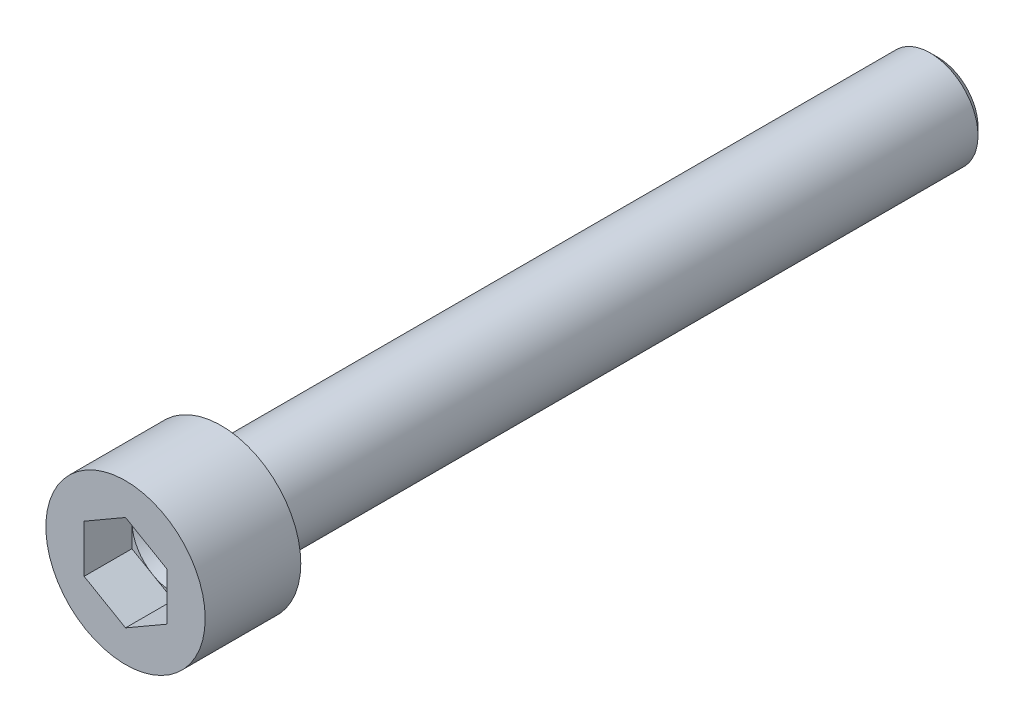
ISO-10303-21;
HEADER;
FILE_DESCRIPTION(('STEP AP214'),'2;1');
FILE_NAME('part.step','',(''),(''),'','','');
FILE_SCHEMA(('AUTOMOTIVE_DESIGN { 1 0 10303 214 1 1 1 1 }'));
ENDSEC;
DATA;
#1=APPLICATION_CONTEXT('core data for automotive mechanical design processes');
#2=APPLICATION_PROTOCOL_DEFINITION('international standard','automotive_design',2000,#1);
#3=PRODUCT_CONTEXT('',#1,'mechanical');
#4=PRODUCT('Part','Part','',(#3));
#5=PRODUCT_RELATED_PRODUCT_CATEGORY('part','',(#4));
#6=PRODUCT_DEFINITION_FORMATION('','',#4);
#7=PRODUCT_DEFINITION_CONTEXT('part definition',#1,'design');
#8=PRODUCT_DEFINITION('design','',#6,#7);
#9=PRODUCT_DEFINITION_SHAPE('','',#8);
#10=(LENGTH_UNIT() NAMED_UNIT(*) SI_UNIT(.MILLI.,.METRE.));
#11=(NAMED_UNIT(*) PLANE_ANGLE_UNIT() SI_UNIT($,.RADIAN.));
#12=(NAMED_UNIT(*) SI_UNIT($,.STERADIAN.) SOLID_ANGLE_UNIT());
#13=UNCERTAINTY_MEASURE_WITH_UNIT(LENGTH_MEASURE(1.E-05),#10,'distance_accuracy_value','');
#14=(GEOMETRIC_REPRESENTATION_CONTEXT(3) GLOBAL_UNCERTAINTY_ASSIGNED_CONTEXT((#13)) GLOBAL_UNIT_ASSIGNED_CONTEXT((#10,
#11,#12)) REPRESENTATION_CONTEXT('',''));
#15=CARTESIAN_POINT('',(0.,0.,0.));
#16=DIRECTION('',(0.,0.,1.));
#17=DIRECTION('',(1.,0.,0.));
#18=AXIS2_PLACEMENT_3D('',#15,#16,#17);
#19=CARTESIAN_POINT('',(0.,0.,-6.));
#20=DIRECTION('',(0.,0.,1.));
#21=DIRECTION('',(1.,0.,0.));
#22=AXIS2_PLACEMENT_3D('',#19,#20,#21);
#23=PLANE('',#22);
#24=CARTESIAN_POINT('',(0.,0.,-6.));
#25=DIRECTION('',(0.,0.,1.));
#26=DIRECTION('',(1.,0.,0.));
#27=AXIS2_PLACEMENT_3D('',#24,#25,#26);
#28=CIRCLE('',#27,5.);
#29=CARTESIAN_POINT('',(5.,0.,-6.));
#30=VERTEX_POINT('',#29);
#31=EDGE_CURVE('E146',#30,#30,#28,.T.);
#32=ORIENTED_EDGE('',*,*,#31,.F.);
#33=EDGE_LOOP('',(#32));
#34=FACE_BOUND('',#33,.T.);
#35=CARTESIAN_POINT('',(0.,0.,-6.));
#36=DIRECTION('',(0.,0.,1.));
#37=DIRECTION('',(1.,0.,0.));
#38=AXIS2_PLACEMENT_3D('',#35,#36,#37);
#39=CIRCLE('',#38,3.);
#40=CARTESIAN_POINT('',(3.,0.,-6.00000000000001));
#41=VERTEX_POINT('',#40);
#42=EDGE_CURVE('E149',#41,#41,#39,.F.);
#43=ORIENTED_EDGE('',*,*,#42,.F.);
#44=EDGE_LOOP('',(#43));
#45=FACE_BOUND('',#44,.T.);
#46=ADVANCED_FACE('F28',(#34,#45),#23,.F.);
#47=CARTESIAN_POINT('',(0.,0.,-6.));
#48=DIRECTION('',(0.,0.,1.));
#49=DIRECTION('',(1.,0.,0.));
#50=AXIS2_PLACEMENT_3D('',#47,#48,#49);
#51=CYLINDRICAL_SURFACE('',#50,5.);
#52=ORIENTED_EDGE('',*,*,#31,.T.);
#53=EDGE_LOOP('',(#52));
#54=FACE_BOUND('',#53,.T.);
#55=CARTESIAN_POINT('',(0.,0.,0.));
#56=DIRECTION('',(0.,0.,1.));
#57=DIRECTION('',(1.,0.,0.));
#58=AXIS2_PLACEMENT_3D('',#55,#56,#57);
#59=CIRCLE('',#58,5.);
#60=CARTESIAN_POINT('',(5.,0.,0.));
#61=VERTEX_POINT('',#60);
#62=EDGE_CURVE('E134',#61,#61,#59,.T.);
#63=ORIENTED_EDGE('',*,*,#62,.F.);
#64=EDGE_LOOP('',(#63));
#65=FACE_BOUND('',#64,.T.);
#66=ADVANCED_FACE('F30',(#54,#65),#51,.T.);
#67=CARTESIAN_POINT('',(0.,0.,0.));
#68=DIRECTION('',(0.,0.,1.));
#69=DIRECTION('',(1.,0.,0.));
#70=AXIS2_PLACEMENT_3D('',#67,#68,#69);
#71=PLANE('',#70);
#72=DIRECTION('',(0.866025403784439,-0.5,0.));
#73=VECTOR('',#72,1.);
#74=CARTESIAN_POINT('',(-2.59807621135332,-1.5,0.));
#75=LINE('',#74,#73);
#76=CARTESIAN_POINT('',(-2.59807621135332,-1.5,0.));
#77=VERTEX_POINT('',#76);
#78=CARTESIAN_POINT('',(0.,-3.,0.));
#79=VERTEX_POINT('',#78);
#80=EDGE_CURVE('E43',#77,#79,#75,.T.);
#81=ORIENTED_EDGE('',*,*,#80,.F.);
#82=DIRECTION('',(0.,-1.,0.));
#83=VECTOR('',#82,1.);
#84=CARTESIAN_POINT('',(-2.59807621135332,1.5,0.));
#85=LINE('',#84,#83);
#86=CARTESIAN_POINT('',(-2.59807621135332,1.5,0.));
#87=VERTEX_POINT('',#86);
#88=EDGE_CURVE('E115',#87,#77,#85,.T.);
#89=ORIENTED_EDGE('',*,*,#88,.F.);
#90=DIRECTION('',(-0.866025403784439,-0.5,0.));
#91=VECTOR('',#90,1.);
#92=CARTESIAN_POINT('',(0.,3.,0.));
#93=LINE('',#92,#91);
#94=CARTESIAN_POINT('',(0.,3.,0.));
#95=VERTEX_POINT('',#94);
#96=EDGE_CURVE('E112',#95,#87,#93,.T.);
#97=ORIENTED_EDGE('',*,*,#96,.F.);
#98=DIRECTION('',(-0.866025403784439,0.5,0.));
#99=VECTOR('',#98,1.);
#100=CARTESIAN_POINT('',(2.59807621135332,1.5,0.));
#101=LINE('',#100,#99);
#102=CARTESIAN_POINT('',(2.59807621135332,1.5,0.));
#103=VERTEX_POINT('',#102);
#104=EDGE_CURVE('E109',#103,#95,#101,.T.);
#105=ORIENTED_EDGE('',*,*,#104,.F.);
#106=DIRECTION('',(0.,1.,0.));
#107=VECTOR('',#106,1.);
#108=CARTESIAN_POINT('',(2.59807621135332,-1.5,0.));
#109=LINE('',#108,#107);
#110=CARTESIAN_POINT('',(2.59807621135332,-1.5,0.));
#111=VERTEX_POINT('',#110);
#112=EDGE_CURVE('E106',#111,#103,#109,.T.);
#113=ORIENTED_EDGE('',*,*,#112,.F.);
#114=DIRECTION('',(0.866025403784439,0.5,0.));
#115=VECTOR('',#114,1.);
#116=CARTESIAN_POINT('',(0.,-3.,0.));
#117=LINE('',#116,#115);
#118=EDGE_CURVE('E97',#79,#111,#117,.T.);
#119=ORIENTED_EDGE('',*,*,#118,.F.);
#120=EDGE_LOOP('',(#81,#89,#97,#105,#113,#119));
#121=FACE_BOUND('',#120,.T.);
#122=ORIENTED_EDGE('',*,*,#62,.T.);
#123=EDGE_LOOP('',(#122));
#124=FACE_BOUND('',#123,.T.);
#125=ADVANCED_FACE('F173',(#121,#124),#71,.T.);
#126=CARTESIAN_POINT('',(0.,0.,-51.));
#127=DIRECTION('',(0.,0.,1.));
#128=DIRECTION('',(1.,0.,0.));
#129=AXIS2_PLACEMENT_3D('',#126,#127,#128);
#130=CYLINDRICAL_SURFACE('',#129,3.);
#131=CARTESIAN_POINT('',(0.,0.,-50.5));
#132=DIRECTION('',(0.,0.,-1.));
#133=DIRECTION('',(-1.,0.,0.));
#134=AXIS2_PLACEMENT_3D('',#131,#132,#133);
#135=CIRCLE('',#134,3.);
#136=CARTESIAN_POINT('',(3.,0.,-50.5));
#137=VERTEX_POINT('',#136);
#138=EDGE_CURVE('E11',#137,#137,#135,.F.);
#139=CARTESIAN_POINT('',(3.,0.,-50.5));
#140=CARTESIAN_POINT('',(3.,0.,-50.0364583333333));
#141=CARTESIAN_POINT('',(3.,0.,-49.5729166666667));
#142=CARTESIAN_POINT('',(3.,0.,-48.6458333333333));
#143=CARTESIAN_POINT('',(3.,0.,-48.1822916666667));
#144=CARTESIAN_POINT('',(3.,0.,-47.2552083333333));
#145=CARTESIAN_POINT('',(3.,0.,-46.7916666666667));
#146=CARTESIAN_POINT('',(3.,0.,-45.8645833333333));
#147=CARTESIAN_POINT('',(3.,0.,-45.4010416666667));
#148=CARTESIAN_POINT('',(3.,0.,-44.4739583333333));
#149=CARTESIAN_POINT('',(3.,0.,-44.0104166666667));
#150=CARTESIAN_POINT('',(3.,0.,-43.0833333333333));
#151=CARTESIAN_POINT('',(3.,0.,-42.6197916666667));
#152=CARTESIAN_POINT('',(3.,0.,-41.6927083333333));
#153=CARTESIAN_POINT('',(3.,0.,-41.2291666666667));
#154=CARTESIAN_POINT('',(3.,0.,-40.3020833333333));
#155=CARTESIAN_POINT('',(3.,0.,-39.8385416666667));
#156=CARTESIAN_POINT('',(3.,0.,-38.9114583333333));
#157=CARTESIAN_POINT('',(3.,0.,-38.4479166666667));
#158=CARTESIAN_POINT('',(3.,0.,-37.5208333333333));
#159=CARTESIAN_POINT('',(3.,0.,-37.0572916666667));
#160=CARTESIAN_POINT('',(3.,0.,-36.1302083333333));
#161=CARTESIAN_POINT('',(3.,0.,-35.6666666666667));
#162=CARTESIAN_POINT('',(3.,0.,-34.7395833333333));
#163=CARTESIAN_POINT('',(3.,0.,-34.2760416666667));
#164=CARTESIAN_POINT('',(3.,0.,-33.3489583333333));
#165=CARTESIAN_POINT('',(3.,0.,-32.8854166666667));
#166=CARTESIAN_POINT('',(3.,0.,-31.9583333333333));
#167=CARTESIAN_POINT('',(3.,0.,-31.4947916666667));
#168=CARTESIAN_POINT('',(3.,0.,-30.5677083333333));
#169=CARTESIAN_POINT('',(3.,0.,-30.1041666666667));
#170=CARTESIAN_POINT('',(3.,0.,-29.1770833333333));
#171=CARTESIAN_POINT('',(3.,0.,-28.7135416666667));
#172=CARTESIAN_POINT('',(3.,0.,-27.7864583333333));
#173=CARTESIAN_POINT('',(3.,0.,-27.3229166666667));
#174=CARTESIAN_POINT('',(3.,0.,-26.3958333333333));
#175=CARTESIAN_POINT('',(3.,0.,-25.9322916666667));
#176=CARTESIAN_POINT('',(3.,0.,-25.0052083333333));
#177=CARTESIAN_POINT('',(3.,0.,-24.5416666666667));
#178=CARTESIAN_POINT('',(3.,0.,-23.6145833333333));
#179=CARTESIAN_POINT('',(3.,0.,-23.1510416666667));
#180=CARTESIAN_POINT('',(3.,0.,-22.2239583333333));
#181=CARTESIAN_POINT('',(3.,0.,-21.7604166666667));
#182=CARTESIAN_POINT('',(3.,0.,-20.8333333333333));
#183=CARTESIAN_POINT('',(3.,0.,-20.3697916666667));
#184=CARTESIAN_POINT('',(3.,0.,-19.4427083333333));
#185=CARTESIAN_POINT('',(3.,0.,-18.9791666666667));
#186=CARTESIAN_POINT('',(3.,0.,-18.0520833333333));
#187=CARTESIAN_POINT('',(3.,0.,-17.5885416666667));
#188=CARTESIAN_POINT('',(3.,0.,-16.6614583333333));
#189=CARTESIAN_POINT('',(3.,0.,-16.1979166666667));
#190=CARTESIAN_POINT('',(3.,0.,-15.2708333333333));
#191=CARTESIAN_POINT('',(3.,0.,-14.8072916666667));
#192=CARTESIAN_POINT('',(3.,0.,-13.8802083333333));
#193=CARTESIAN_POINT('',(3.,0.,-13.4166666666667));
#194=CARTESIAN_POINT('',(3.,0.,-12.4895833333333));
#195=CARTESIAN_POINT('',(3.,0.,-12.0260416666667));
#196=CARTESIAN_POINT('',(3.,0.,-11.0989583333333));
#197=CARTESIAN_POINT('',(3.,0.,-10.6354166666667));
#198=CARTESIAN_POINT('',(3.,0.,-9.70833333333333));
#199=CARTESIAN_POINT('',(3.,0.,-9.24479166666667));
#200=CARTESIAN_POINT('',(3.,0.,-8.31770833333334));
#201=CARTESIAN_POINT('',(3.,0.,-7.85416666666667));
#202=CARTESIAN_POINT('',(3.,0.,-6.92708333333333));
#203=CARTESIAN_POINT('',(3.,0.,-6.46354166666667));
#204=CARTESIAN_POINT('',(3.,0.,-6.00000000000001));
#205=B_SPLINE_CURVE_WITH_KNOTS('',3,(#139,#140,#141,#142,#143,#144,#145,#146,#147,#148,#149,
#150,#151,#152,#153,#154,#155,#156,#157,#158,#159,#160,#161,#162,#163,#164,#165,#166,#167,#168,
#169,#170,#171,#172,#173,#174,#175,#176,#177,#178,#179,#180,#181,#182,#183,#184,#185,#186,#187,
#188,#189,#190,#191,#192,#193,#194,#195,#196,#197,#198,#199,#200,#201,#202,#203,#204),
.UNSPECIFIED.,.F.,.F.,(4,2,2,2,2,2,2,2,2,2,2,2,2,2,2,2,2,2,2,2,2,2,2,2,2,2,2,2,2,2,2,2,4),(0.,
1.39062500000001,2.78125000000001,4.17187500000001,5.56250000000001,6.953125,8.34375,9.734375,
11.125,12.515625,13.90625,15.296875,16.6875,18.078125,19.46875,20.859375,22.25,23.640625,
25.03125,26.421875,27.8125,29.203125,30.59375,31.984375,33.375,34.765625,36.15625,37.546875,
38.9375,40.328125,41.71875,43.109375,44.5),.UNSPECIFIED.);
#206=EDGE_CURVE('BSEAM180',#137,#41,#205,.T.);
#207=ORIENTED_EDGE('',*,*,#138,.T.);
#208=ORIENTED_EDGE('',*,*,#42,.T.);
#209=ORIENTED_EDGE('',*,*,#206,.T.);
#210=ORIENTED_EDGE('',*,*,#206,.F.);
#211=EDGE_LOOP('',(#207,#209,#208,#210));
#212=FACE_BOUND('',#211,.T.);
#213=ADVANCED_FACE('F180',(#212),#130,.T.);
#214=CARTESIAN_POINT('',(0.,0.,-51.));
#215=DIRECTION('',(0.,0.,-1.));
#216=DIRECTION('',(-1.,0.,0.));
#217=AXIS2_PLACEMENT_3D('',#214,#215,#216);
#218=PLANE('',#217);
#219=CARTESIAN_POINT('',(0.,0.,-51.));
#220=DIRECTION('',(0.,0.,-1.));
#221=DIRECTION('',(-1.,0.,0.));
#222=AXIS2_PLACEMENT_3D('',#219,#220,#221);
#223=CIRCLE('',#222,2.5);
#224=CARTESIAN_POINT('',(-2.5,0.,-51.));
#225=VERTEX_POINT('',#224);
#226=EDGE_CURVE('E36',#225,#225,#223,.T.);
#227=ORIENTED_EDGE('',*,*,#226,.T.);
#228=EDGE_LOOP('',(#227));
#229=FACE_BOUND('',#228,.T.);
#230=ADVANCED_FACE('F154',(#229),#218,.T.);
#231=CARTESIAN_POINT('',(-2.59807621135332,-1.5,-3.));
#232=DIRECTION('',(-0.5,-0.866025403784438,0.));
#233=DIRECTION('',(0.866025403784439,-0.5,0.));
#234=AXIS2_PLACEMENT_3D('',#231,#232,#233);
#235=PLANE('',#234);
#236=ORIENTED_EDGE('',*,*,#80,.T.);
#237=DIRECTION('',(0.,0.,1.));
#238=VECTOR('',#237,1.);
#239=CARTESIAN_POINT('',(0.,-3.,-3.));
#240=LINE('',#239,#238);
#241=CARTESIAN_POINT('',(2.59299926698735E-06,-2.99999999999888,-3.));
#242=VERTEX_POINT('',#241);
#243=EDGE_CURVE('E131',#242,#79,#240,.T.);
#244=ORIENTED_EDGE('',*,*,#243,.F.);
#245=DIRECTION('',(0.866025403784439,-0.5,0.));
#246=VECTOR('',#245,1.);
#247=CARTESIAN_POINT('',(-2.59807621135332,-1.5,-3.));
#248=LINE('',#247,#246);
#249=CARTESIAN_POINT('',(-2.59807491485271,-1.50000224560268,-3.));
#250=VERTEX_POINT('',#249);
#251=EDGE_CURVE('E118',#250,#242,#248,.T.);
#252=ORIENTED_EDGE('',*,*,#251,.F.);
#253=DIRECTION('',(0.,0.,1.));
#254=VECTOR('',#253,1.);
#255=CARTESIAN_POINT('',(-2.59807621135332,-1.5,-3.));
#256=LINE('',#255,#254);
#257=EDGE_CURVE('E132',#250,#77,#256,.T.);
#258=ORIENTED_EDGE('',*,*,#257,.T.);
#259=EDGE_LOOP('',(#236,#244,#252,#258));
#260=FACE_BOUND('',#259,.T.);
#261=ADVANCED_FACE('F187',(#260),#235,.F.);
#262=CARTESIAN_POINT('',(-2.59807621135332,1.5,-3.));
#263=DIRECTION('',(-1.,0.,0.));
#264=DIRECTION('',(0.,-1.,0.));
#265=AXIS2_PLACEMENT_3D('',#262,#263,#264);
#266=PLANE('',#265);
#267=ORIENTED_EDGE('',*,*,#88,.T.);
#268=ORIENTED_EDGE('',*,*,#257,.F.);
#269=DIRECTION('',(0.,-1.,0.));
#270=VECTOR('',#269,1.);
#271=CARTESIAN_POINT('',(-2.59807621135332,1.5,-3.));
#272=LINE('',#271,#270);
#273=CARTESIAN_POINT('',(-2.59807621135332,1.5,-3.));
#274=VERTEX_POINT('',#273);
#275=EDGE_CURVE('E129',#274,#250,#272,.T.);
#276=ORIENTED_EDGE('',*,*,#275,.F.);
#277=DIRECTION('',(0.,0.,1.));
#278=VECTOR('',#277,1.);
#279=CARTESIAN_POINT('',(-2.59807621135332,1.5,-3.));
#280=LINE('',#279,#278);
#281=EDGE_CURVE('E135',#274,#87,#280,.T.);
#282=ORIENTED_EDGE('',*,*,#281,.T.);
#283=EDGE_LOOP('',(#267,#268,#276,#282));
#284=FACE_BOUND('',#283,.T.);
#285=ADVANCED_FACE('F190',(#284),#266,.F.);
#286=CARTESIAN_POINT('',(0.,3.,-3.));
#287=DIRECTION('',(-0.5,0.866025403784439,0.));
#288=DIRECTION('',(-0.866025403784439,-0.5,0.));
#289=AXIS2_PLACEMENT_3D('',#286,#287,#288);
#290=PLANE('',#289);
#291=ORIENTED_EDGE('',*,*,#96,.T.);
#292=ORIENTED_EDGE('',*,*,#281,.F.);
#293=DIRECTION('',(-0.866025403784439,-0.5,0.));
#294=VECTOR('',#293,1.);
#295=CARTESIAN_POINT('',(0.,3.,-3.));
#296=LINE('',#295,#294);
#297=CARTESIAN_POINT('',(-2.59299926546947E-06,2.99999999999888,-3.));
#298=VERTEX_POINT('',#297);
#299=EDGE_CURVE('E126',#298,#274,#296,.T.);
#300=ORIENTED_EDGE('',*,*,#299,.F.);
#301=DIRECTION('',(0.,0.,1.));
#302=VECTOR('',#301,1.);
#303=CARTESIAN_POINT('',(0.,3.,-3.));
#304=LINE('',#303,#302);
#305=EDGE_CURVE('E137',#298,#95,#304,.T.);
#306=ORIENTED_EDGE('',*,*,#305,.T.);
#307=EDGE_LOOP('',(#291,#292,#300,#306));
#308=FACE_BOUND('',#307,.T.);
#309=ADVANCED_FACE('F203',(#308),#290,.F.);
#310=CARTESIAN_POINT('',(2.59807621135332,1.5,-3.));
#311=DIRECTION('',(0.5,0.866025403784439,0.));
#312=DIRECTION('',(-0.866025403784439,0.5,0.));
#313=AXIS2_PLACEMENT_3D('',#310,#311,#312);
#314=PLANE('',#313);
#315=ORIENTED_EDGE('',*,*,#104,.T.);
#316=ORIENTED_EDGE('',*,*,#305,.F.);
#317=DIRECTION('',(-0.866025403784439,0.5,0.));
#318=VECTOR('',#317,1.);
#319=CARTESIAN_POINT('',(2.59807621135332,1.5,-3.));
#320=LINE('',#319,#318);
#321=CARTESIAN_POINT('',(2.59807491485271,1.50000224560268,-3.));
#322=VERTEX_POINT('',#321);
#323=EDGE_CURVE('E124',#322,#298,#320,.T.);
#324=ORIENTED_EDGE('',*,*,#323,.F.);
#325=DIRECTION('',(0.,0.,1.));
#326=VECTOR('',#325,1.);
#327=CARTESIAN_POINT('',(2.59807621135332,1.5,-3.));
#328=LINE('',#327,#326);
#329=EDGE_CURVE('E139',#322,#103,#328,.T.);
#330=ORIENTED_EDGE('',*,*,#329,.T.);
#331=EDGE_LOOP('',(#315,#316,#324,#330));
#332=FACE_BOUND('',#331,.T.);
#333=ADVANCED_FACE('F199',(#332),#314,.F.);
#334=CARTESIAN_POINT('',(2.59807621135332,-1.5,-3.));
#335=DIRECTION('',(1.,0.,0.));
#336=DIRECTION('',(0.,1.,0.));
#337=AXIS2_PLACEMENT_3D('',#334,#335,#336);
#338=PLANE('',#337);
#339=ORIENTED_EDGE('',*,*,#112,.T.);
#340=ORIENTED_EDGE('',*,*,#329,.F.);
#341=DIRECTION('',(0.,1.,0.));
#342=VECTOR('',#341,1.);
#343=CARTESIAN_POINT('',(2.59807621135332,-1.5,-3.));
#344=LINE('',#343,#342);
#345=CARTESIAN_POINT('',(2.59807750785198,-1.4999977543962,-3.));
#346=VERTEX_POINT('',#345);
#347=EDGE_CURVE('E122',#346,#322,#344,.T.);
#348=ORIENTED_EDGE('',*,*,#347,.F.);
#349=DIRECTION('',(0.,0.,1.));
#350=VECTOR('',#349,1.);
#351=CARTESIAN_POINT('',(2.59807621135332,-1.5,-3.));
#352=LINE('',#351,#350);
#353=EDGE_CURVE('E141',#346,#111,#352,.T.);
#354=ORIENTED_EDGE('',*,*,#353,.T.);
#355=EDGE_LOOP('',(#339,#340,#348,#354));
#356=FACE_BOUND('',#355,.T.);
#357=ADVANCED_FACE('F195',(#356),#338,.F.);
#358=CARTESIAN_POINT('',(0.,-3.,-3.));
#359=DIRECTION('',(0.5,-0.866025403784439,0.));
#360=DIRECTION('',(0.866025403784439,0.5,0.));
#361=AXIS2_PLACEMENT_3D('',#358,#359,#360);
#362=PLANE('',#361);
#363=ORIENTED_EDGE('',*,*,#118,.T.);
#364=ORIENTED_EDGE('',*,*,#353,.F.);
#365=DIRECTION('',(0.866025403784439,0.5,0.));
#366=VECTOR('',#365,1.);
#367=CARTESIAN_POINT('',(0.,-3.,-3.));
#368=LINE('',#367,#366);
#369=EDGE_CURVE('E120',#242,#346,#368,.T.);
#370=ORIENTED_EDGE('',*,*,#369,.F.);
#371=ORIENTED_EDGE('',*,*,#243,.T.);
#372=EDGE_LOOP('',(#363,#364,#370,#371));
#373=FACE_BOUND('',#372,.T.);
#374=ADVANCED_FACE('F191',(#373),#362,.F.);
#375=CARTESIAN_POINT('',(3.,0.,-3.));
#376=DIRECTION('',(0.,0.,1.));
#377=DIRECTION('',(1.,0.,0.));
#378=AXIS2_PLACEMENT_3D('',#375,#376,#377);
#379=PLANE('',#378);
#380=ORIENTED_EDGE('',*,*,#251,.T.);
#381=CARTESIAN_POINT('',(0.,0.,-3.));
#382=DIRECTION('',(0.,0.,1.));
#383=DIRECTION('',(1.,0.,0.));
#384=AXIS2_PLACEMENT_3D('',#381,#382,#383);
#385=CIRCLE('',#384,3.);
#386=EDGE_CURVE('E235',#250,#242,#385,.T.);
#387=ORIENTED_EDGE('',*,*,#386,.F.);
#388=EDGE_LOOP('',(#380,#387));
#389=FACE_BOUND('',#388,.T.);
#390=ADVANCED_FACE('F194',(#389),#379,.F.);
#391=ORIENTED_EDGE('',*,*,#369,.T.);
#392=EDGE_CURVE('E232',#242,#346,#385,.T.);
#393=ORIENTED_EDGE('',*,*,#392,.F.);
#394=EDGE_LOOP('',(#391,#393));
#395=FACE_BOUND('',#394,.T.);
#396=ADVANCED_FACE('F247',(#395),#379,.F.);
#397=ORIENTED_EDGE('',*,*,#347,.T.);
#398=EDGE_CURVE('E227',#346,#322,#385,.T.);
#399=ORIENTED_EDGE('',*,*,#398,.F.);
#400=EDGE_LOOP('',(#397,#399));
#401=FACE_BOUND('',#400,.T.);
#402=ADVANCED_FACE('F249',(#401),#379,.F.);
#403=ORIENTED_EDGE('',*,*,#323,.T.);
#404=EDGE_CURVE('E225',#322,#298,#385,.T.);
#405=ORIENTED_EDGE('',*,*,#404,.F.);
#406=EDGE_LOOP('',(#403,#405));
#407=FACE_BOUND('',#406,.T.);
#408=ADVANCED_FACE('F257',(#407),#379,.F.);
#409=ORIENTED_EDGE('',*,*,#299,.T.);
#410=EDGE_CURVE('E51',#298,#274,#385,.T.);
#411=ORIENTED_EDGE('',*,*,#410,.F.);
#412=EDGE_LOOP('',(#409,#411));
#413=FACE_BOUND('',#412,.T.);
#414=ADVANCED_FACE('F212',(#413),#379,.F.);
#415=ORIENTED_EDGE('',*,*,#275,.T.);
#416=EDGE_CURVE('E231',#274,#250,#385,.T.);
#417=ORIENTED_EDGE('',*,*,#416,.F.);
#418=EDGE_LOOP('',(#415,#417));
#419=FACE_BOUND('',#418,.T.);
#420=ADVANCED_FACE('F89',(#419),#379,.F.);
#421=CARTESIAN_POINT('',(0.,0.,-3.0002));
#422=DIRECTION('',(0.,0.,1.));
#423=DIRECTION('',(1.,0.,0.));
#424=AXIS2_PLACEMENT_3D('',#421,#422,#423);
#425=CONICAL_SURFACE('',#424,2.5999948,1.02974425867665);
#426=CARTESIAN_POINT('',(0.,0.,-4.56243448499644));
#427=VERTEX_POINT('',#426);
#428=VERTEX_LOOP('',#427);
#429=FACE_BOUND('',#428,.T.);
#430=CARTESIAN_POINT('',(0.,0.,-3.0002));
#431=DIRECTION('',(0.,0.,1.));
#432=DIRECTION('',(1.,0.,0.));
#433=AXIS2_PLACEMENT_3D('',#430,#431,#432);
#434=CIRCLE('',#433,2.5999948);
#435=CARTESIAN_POINT('',(2.5999948,0.,-3.0002));
#436=VERTEX_POINT('',#435);
#437=EDGE_CURVE('E93',#436,#436,#434,.T.);
#438=ORIENTED_EDGE('',*,*,#437,.T.);
#439=EDGE_LOOP('',(#438));
#440=FACE_BOUND('',#439,.T.);
#441=ADVANCED_FACE('F85',(#429,#440),#425,.F.);
#442=CARTESIAN_POINT('',(0.,0.,-3.));
#443=DIRECTION('',(0.,0.,1.));
#444=DIRECTION('',(1.,0.,0.));
#445=AXIS2_PLACEMENT_3D('',#442,#443,#444);
#446=CYLINDRICAL_SURFACE('',#445,2.5999948);
#447=ORIENTED_EDGE('',*,*,#437,.F.);
#448=EDGE_LOOP('',(#447));
#449=FACE_BOUND('',#448,.T.);
#450=CARTESIAN_POINT('',(0.,0.,-3.0001));
#451=DIRECTION('',(0.,0.,1.));
#452=DIRECTION('',(1.,0.,0.));
#453=AXIS2_PLACEMENT_3D('',#450,#451,#452);
#454=CIRCLE('',#453,2.59999480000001);
#455=CARTESIAN_POINT('',(2.59999480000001,0.,-3.0001));
#456=VERTEX_POINT('',#455);
#457=EDGE_CURVE('E95',#456,#456,#454,.T.);
#458=ORIENTED_EDGE('',*,*,#457,.T.);
#459=EDGE_LOOP('',(#458));
#460=FACE_BOUND('',#459,.T.);
#461=ADVANCED_FACE('F88',(#449,#460),#446,.F.);
#462=CARTESIAN_POINT('',(2.59999480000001,0.,-3.0001));
#463=DIRECTION('',(0.,0.,-1.));
#464=DIRECTION('',(-1.,0.,0.));
#465=AXIS2_PLACEMENT_3D('',#462,#463,#464);
#466=PLANE('',#465);
#467=ORIENTED_EDGE('',*,*,#457,.F.);
#468=EDGE_LOOP('',(#467));
#469=FACE_BOUND('',#468,.T.);
#470=CARTESIAN_POINT('',(0.,0.,-3.0001));
#471=DIRECTION('',(0.,0.,1.));
#472=DIRECTION('',(1.,0.,0.));
#473=AXIS2_PLACEMENT_3D('',#470,#471,#472);
#474=CIRCLE('',#473,2.99999700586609);
#475=CARTESIAN_POINT('',(2.99999700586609,0.,-3.0001));
#476=VERTEX_POINT('',#475);
#477=EDGE_CURVE('E100',#476,#476,#474,.T.);
#478=ORIENTED_EDGE('',*,*,#477,.T.);
#479=EDGE_LOOP('',(#478));
#480=FACE_BOUND('',#479,.T.);
#481=ADVANCED_FACE('F164',(#469,#480),#466,.F.);
#482=CARTESIAN_POINT('',(0.,0.,-3.));
#483=DIRECTION('',(0.,0.,1.));
#484=DIRECTION('',(1.,0.,0.));
#485=AXIS2_PLACEMENT_3D('',#482,#483,#484);
#486=CYLINDRICAL_SURFACE('',#485,2.99999850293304);
#487=ORIENTED_EDGE('',*,*,#477,.F.);
#488=EDGE_LOOP('',(#487));
#489=FACE_BOUND('',#488,.T.);
#490=ORIENTED_EDGE('',*,*,#404,.T.);
#491=ORIENTED_EDGE('',*,*,#410,.T.);
#492=ORIENTED_EDGE('',*,*,#416,.T.);
#493=ORIENTED_EDGE('',*,*,#386,.T.);
#494=ORIENTED_EDGE('',*,*,#392,.T.);
#495=ORIENTED_EDGE('',*,*,#398,.T.);
#496=EDGE_LOOP('',(#490,#491,#492,#493,#494,#495));
#497=FACE_BOUND('',#496,.T.);
#498=ADVANCED_FACE('F158',(#489,#497),#486,.F.);
#499=CARTESIAN_POINT('',(0.,0.,-51.));
#500=DIRECTION('',(0.,0.,1.));
#501=DIRECTION('',(1.,0.,0.));
#502=AXIS2_PLACEMENT_3D('',#499,#500,#501);
#503=CONICAL_SURFACE('',#502,2.5,0.785398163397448);
#504=ORIENTED_EDGE('',*,*,#138,.F.);
#505=EDGE_LOOP('',(#504));
#506=FACE_BOUND('',#505,.T.);
#507=ORIENTED_EDGE('',*,*,#226,.F.);
#508=EDGE_LOOP('',(#507));
#509=FACE_BOUND('',#508,.T.);
#510=ADVANCED_FACE('F156',(#506,#509),#503,.T.);
#511=CLOSED_SHELL('',(#46,#66,#125,#213,#230,#261,#285,#309,#333,#357,#374,#390,#396,#402,#408,
#414,#420,#441,#461,#481,#498,#510));
#512=MANIFOLD_SOLID_BREP('B2',#511);
#513=ADVANCED_BREP_SHAPE_REPRESENTATION('',(#18,#512),#14);
#514=SHAPE_DEFINITION_REPRESENTATION(#9,#513);
ENDSEC;
END-ISO-10303-21;
